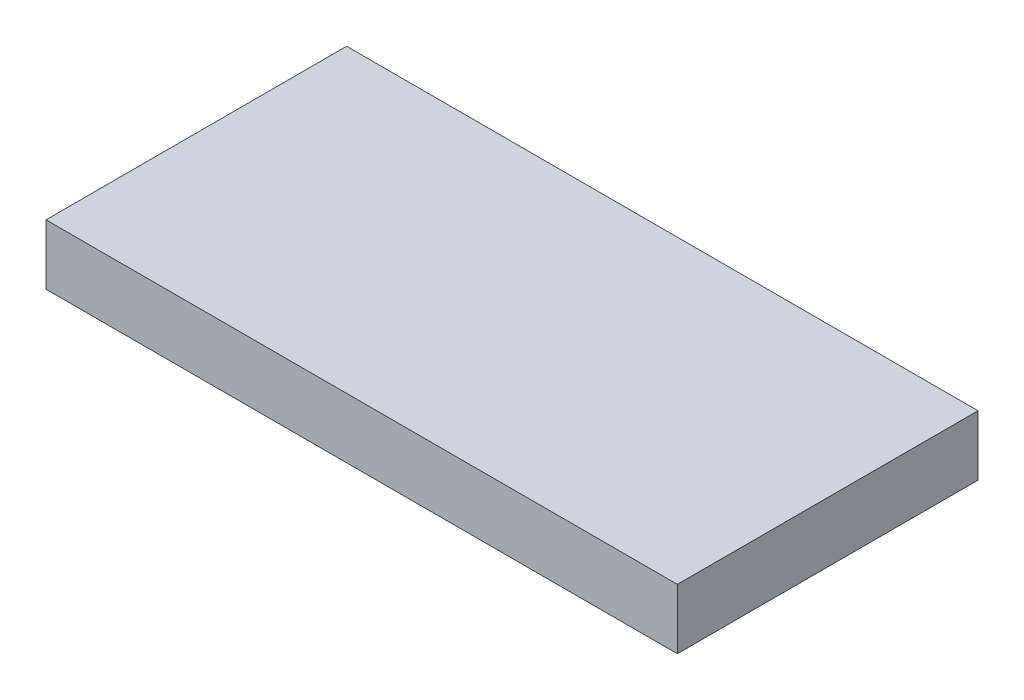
from build123d import *

# Parameters (mm, degrees)
SKETCH1_W           = 53.34
SKETCH1_H           = 25.4
BOSS_EXTRUDE1_DEPTH = 5.08


with BuildPart() as part:
    # Sketch1 → Boss-Extrude1 (new body)
    with BuildSketch(Plane(origin=(0, 0, 0), x_dir=(1, 0, 0), z_dir=(0, 1, 0))):
        with Locations((-7.62, 2.54)):
            Rectangle(SKETCH1_W, SKETCH1_H)
    extrude(amount=BOSS_EXTRUDE1_DEPTH)


solid = part.part
